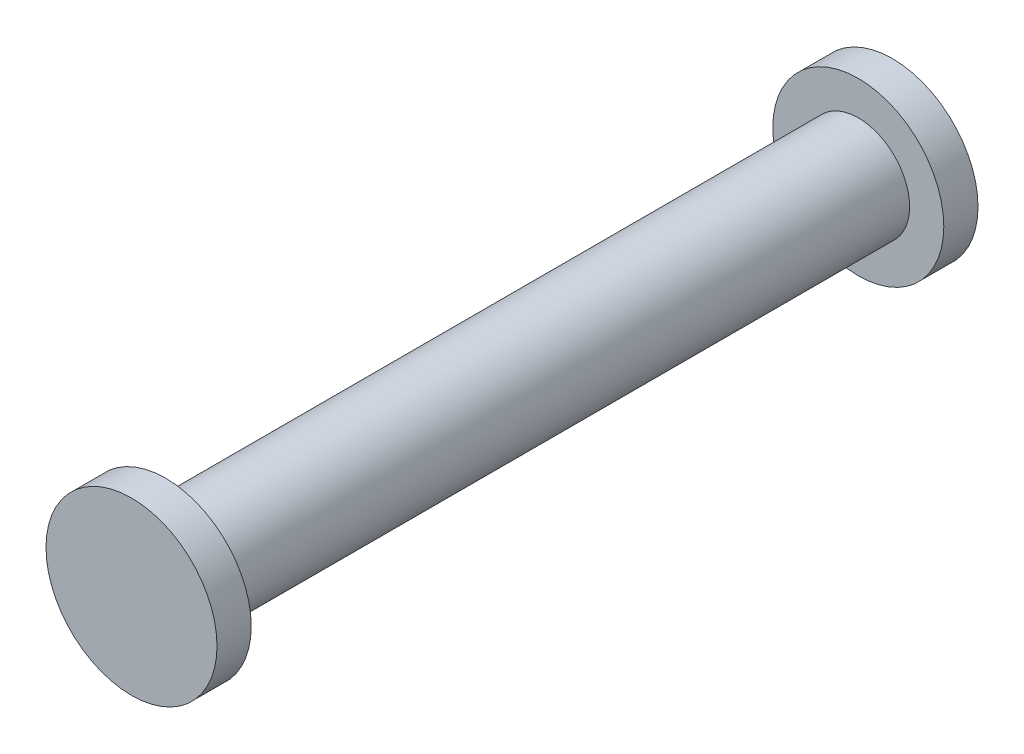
ISO-10303-21;
HEADER;
FILE_DESCRIPTION(('STEP AP214'),'2;1');
FILE_NAME('part.step','',(''),(''),'','','');
FILE_SCHEMA(('AUTOMOTIVE_DESIGN { 1 0 10303 214 1 1 1 1 }'));
ENDSEC;
DATA;
#1=APPLICATION_CONTEXT('core data for automotive mechanical design processes');
#2=APPLICATION_PROTOCOL_DEFINITION('international standard','automotive_design',2000,#1);
#3=PRODUCT_CONTEXT('',#1,'mechanical');
#4=PRODUCT('Part','Part','',(#3));
#5=PRODUCT_RELATED_PRODUCT_CATEGORY('part','',(#4));
#6=PRODUCT_DEFINITION_FORMATION('','',#4);
#7=PRODUCT_DEFINITION_CONTEXT('part definition',#1,'design');
#8=PRODUCT_DEFINITION('design','',#6,#7);
#9=PRODUCT_DEFINITION_SHAPE('','',#8);
#10=(LENGTH_UNIT() NAMED_UNIT(*) SI_UNIT(.MILLI.,.METRE.));
#11=(NAMED_UNIT(*) PLANE_ANGLE_UNIT() SI_UNIT($,.RADIAN.));
#12=(NAMED_UNIT(*) SI_UNIT($,.STERADIAN.) SOLID_ANGLE_UNIT());
#13=UNCERTAINTY_MEASURE_WITH_UNIT(LENGTH_MEASURE(1.E-05),#10,'distance_accuracy_value','');
#14=(GEOMETRIC_REPRESENTATION_CONTEXT(3) GLOBAL_UNCERTAINTY_ASSIGNED_CONTEXT((#13)) GLOBAL_UNIT_ASSIGNED_CONTEXT((#10,
#11,#12)) REPRESENTATION_CONTEXT('',''));
#15=CARTESIAN_POINT('',(0.,0.,0.));
#16=DIRECTION('',(0.,0.,1.));
#17=DIRECTION('',(1.,0.,0.));
#18=AXIS2_PLACEMENT_3D('',#15,#16,#17);
#19=CARTESIAN_POINT('',(0.,0.,-22.25));
#20=DIRECTION('',(0.,0.,1.));
#21=DIRECTION('',(1.,0.,0.));
#22=AXIS2_PLACEMENT_3D('',#19,#20,#21);
#23=CYLINDRICAL_SURFACE('',#22,5.);
#24=CARTESIAN_POINT('',(0.,0.,-22.25));
#25=DIRECTION('',(0.,0.,1.));
#26=DIRECTION('',(1.,0.,0.));
#27=AXIS2_PLACEMENT_3D('',#24,#25,#26);
#28=CIRCLE('',#27,5.);
#29=CARTESIAN_POINT('',(5.,0.,-22.25));
#30=VERTEX_POINT('',#29);
#31=EDGE_CURVE('E10',#30,#30,#28,.T.);
#32=ORIENTED_EDGE('',*,*,#31,.T.);
#33=EDGE_LOOP('',(#32));
#34=FACE_BOUND('',#33,.T.);
#35=CARTESIAN_POINT('',(0.,0.,-20.25));
#36=DIRECTION('',(0.,0.,1.));
#37=DIRECTION('',(1.,0.,0.));
#38=AXIS2_PLACEMENT_3D('',#35,#36,#37);
#39=CIRCLE('',#38,5.);
#40=CARTESIAN_POINT('',(5.,0.,-20.25));
#41=VERTEX_POINT('',#40);
#42=EDGE_CURVE('E43',#41,#41,#39,.F.);
#43=ORIENTED_EDGE('',*,*,#42,.T.);
#44=EDGE_LOOP('',(#43));
#45=FACE_BOUND('',#44,.T.);
#46=ADVANCED_FACE('F39',(#34,#45),#23,.T.);
#47=CARTESIAN_POINT('',(0.,0.,-22.25));
#48=DIRECTION('',(0.,0.,1.));
#49=DIRECTION('',(1.,0.,0.));
#50=AXIS2_PLACEMENT_3D('',#47,#48,#49);
#51=PLANE('',#50);
#52=ORIENTED_EDGE('',*,*,#31,.F.);
#53=EDGE_LOOP('',(#52));
#54=FACE_BOUND('',#53,.T.);
#55=ADVANCED_FACE('F84',(#54),#51,.F.);
#56=CARTESIAN_POINT('',(0.,0.,-20.25));
#57=DIRECTION('',(0.,0.,1.));
#58=DIRECTION('',(1.,0.,0.));
#59=AXIS2_PLACEMENT_3D('',#56,#57,#58);
#60=PLANE('',#59);
#61=ORIENTED_EDGE('',*,*,#42,.F.);
#62=EDGE_LOOP('',(#61));
#63=FACE_BOUND('',#62,.T.);
#64=CARTESIAN_POINT('',(0.,0.,-20.25));
#65=DIRECTION('',(0.,0.,1.));
#66=DIRECTION('',(1.,0.,0.));
#67=AXIS2_PLACEMENT_3D('',#64,#65,#66);
#68=CIRCLE('',#67,3.);
#69=CARTESIAN_POINT('',(3.,0.,-20.25));
#70=VERTEX_POINT('',#69);
#71=EDGE_CURVE('E58',#70,#70,#68,.T.);
#72=ORIENTED_EDGE('',*,*,#71,.F.);
#73=EDGE_LOOP('',(#72));
#74=FACE_BOUND('',#73,.T.);
#75=ADVANCED_FACE('F80',(#63,#74),#60,.T.);
#76=CARTESIAN_POINT('',(0.,0.,20.25));
#77=DIRECTION('',(0.,0.,1.));
#78=DIRECTION('',(1.,0.,0.));
#79=AXIS2_PLACEMENT_3D('',#76,#77,#78);
#80=PLANE('',#79);
#81=CARTESIAN_POINT('',(0.,0.,20.25));
#82=DIRECTION('',(0.,0.,1.));
#83=DIRECTION('',(1.,0.,0.));
#84=AXIS2_PLACEMENT_3D('',#81,#82,#83);
#85=CIRCLE('',#84,5.);
#86=CARTESIAN_POINT('',(5.,0.,20.25));
#87=VERTEX_POINT('',#86);
#88=EDGE_CURVE('E56',#87,#87,#85,.F.);
#89=ORIENTED_EDGE('',*,*,#88,.T.);
#90=EDGE_LOOP('',(#89));
#91=FACE_BOUND('',#90,.T.);
#92=CARTESIAN_POINT('',(0.,0.,20.25));
#93=DIRECTION('',(0.,0.,1.));
#94=DIRECTION('',(1.,0.,0.));
#95=AXIS2_PLACEMENT_3D('',#92,#93,#94);
#96=CIRCLE('',#95,3.);
#97=CARTESIAN_POINT('',(3.,0.,20.25));
#98=VERTEX_POINT('',#97);
#99=EDGE_CURVE('E54',#98,#98,#96,.T.);
#100=ORIENTED_EDGE('',*,*,#99,.T.);
#101=EDGE_LOOP('',(#100));
#102=FACE_BOUND('',#101,.T.);
#103=ADVANCED_FACE('F68',(#91,#102),#80,.F.);
#104=CARTESIAN_POINT('',(0.,0.,-20.25));
#105=DIRECTION('',(0.,0.,1.));
#106=DIRECTION('',(1.,0.,0.));
#107=AXIS2_PLACEMENT_3D('',#104,#105,#106);
#108=CYLINDRICAL_SURFACE('',#107,3.);
#109=ORIENTED_EDGE('',*,*,#71,.T.);
#110=EDGE_LOOP('',(#109));
#111=FACE_BOUND('',#110,.T.);
#112=ORIENTED_EDGE('',*,*,#99,.F.);
#113=EDGE_LOOP('',(#112));
#114=FACE_BOUND('',#113,.T.);
#115=ADVANCED_FACE('F70',(#111,#114),#108,.T.);
#116=CARTESIAN_POINT('',(0.,0.,22.25));
#117=DIRECTION('',(0.,0.,1.));
#118=DIRECTION('',(1.,0.,0.));
#119=AXIS2_PLACEMENT_3D('',#116,#117,#118);
#120=PLANE('',#119);
#121=CARTESIAN_POINT('',(0.,0.,22.25));
#122=DIRECTION('',(0.,0.,1.));
#123=DIRECTION('',(1.,0.,0.));
#124=AXIS2_PLACEMENT_3D('',#121,#122,#123);
#125=CIRCLE('',#124,5.);
#126=CARTESIAN_POINT('',(5.,0.,22.25));
#127=VERTEX_POINT('',#126);
#128=EDGE_CURVE('E47',#127,#127,#125,.T.);
#129=ORIENTED_EDGE('',*,*,#128,.T.);
#130=EDGE_LOOP('',(#129));
#131=FACE_BOUND('',#130,.T.);
#132=ADVANCED_FACE('F72',(#131),#120,.T.);
#133=ORIENTED_EDGE('',*,*,#88,.F.);
#134=EDGE_LOOP('',(#133));
#135=FACE_BOUND('',#134,.T.);
#136=ORIENTED_EDGE('',*,*,#128,.F.);
#137=EDGE_LOOP('',(#136));
#138=FACE_BOUND('',#137,.T.);
#139=ADVANCED_FACE('F41',(#135,#138),#23,.T.);
#140=CLOSED_SHELL('',(#46,#55,#75,#103,#115,#132,#139));
#141=MANIFOLD_SOLID_BREP('B2',#140);
#142=ADVANCED_BREP_SHAPE_REPRESENTATION('',(#18,#141),#14);
#143=SHAPE_DEFINITION_REPRESENTATION(#9,#142);
ENDSEC;
END-ISO-10303-21;
